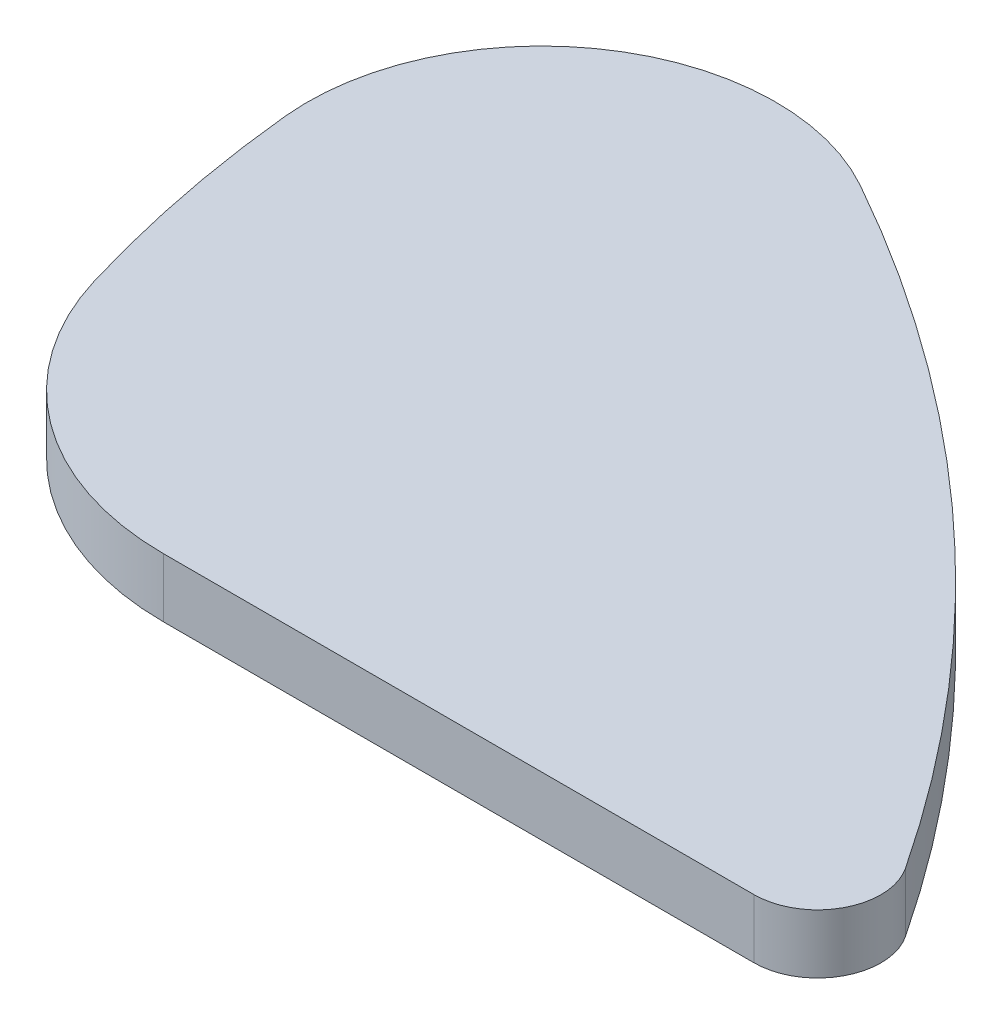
ISO-10303-21;
HEADER;
FILE_DESCRIPTION(('STEP AP214'),'2;1');
FILE_NAME('part.step','',(''),(''),'','','');
FILE_SCHEMA(('AUTOMOTIVE_DESIGN { 1 0 10303 214 1 1 1 1 }'));
ENDSEC;
DATA;
#1=APPLICATION_CONTEXT('core data for automotive mechanical design processes');
#2=APPLICATION_PROTOCOL_DEFINITION('international standard','automotive_design',2000,#1);
#3=PRODUCT_CONTEXT('',#1,'mechanical');
#4=PRODUCT('Part','Part','',(#3));
#5=PRODUCT_RELATED_PRODUCT_CATEGORY('part','',(#4));
#6=PRODUCT_DEFINITION_FORMATION('','',#4);
#7=PRODUCT_DEFINITION_CONTEXT('part definition',#1,'design');
#8=PRODUCT_DEFINITION('design','',#6,#7);
#9=PRODUCT_DEFINITION_SHAPE('','',#8);
#10=(LENGTH_UNIT() NAMED_UNIT(*) SI_UNIT(.MILLI.,.METRE.));
#11=(NAMED_UNIT(*) PLANE_ANGLE_UNIT() SI_UNIT($,.RADIAN.));
#12=(NAMED_UNIT(*) SI_UNIT($,.STERADIAN.) SOLID_ANGLE_UNIT());
#13=UNCERTAINTY_MEASURE_WITH_UNIT(LENGTH_MEASURE(1.E-05),#10,'distance_accuracy_value','');
#14=(GEOMETRIC_REPRESENTATION_CONTEXT(3) GLOBAL_UNCERTAINTY_ASSIGNED_CONTEXT((#13)) GLOBAL_UNIT_ASSIGNED_CONTEXT((#10,
#11,#12)) REPRESENTATION_CONTEXT('',''));
#15=CARTESIAN_POINT('',(0.,0.,0.));
#16=DIRECTION('',(0.,0.,1.));
#17=DIRECTION('',(1.,0.,0.));
#18=AXIS2_PLACEMENT_3D('',#15,#16,#17);
#19=CARTESIAN_POINT('',(0.,10.,-47.8588096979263));
#20=DIRECTION('',(0.,-1.,0.));
#21=DIRECTION('',(0.,0.,-1.));
#22=AXIS2_PLACEMENT_3D('',#19,#20,#21);
#23=CYLINDRICAL_SURFACE('',#22,47.8588096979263);
#24=CARTESIAN_POINT('',(0.,0.,-47.8588096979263));
#25=DIRECTION('',(0.,1.,0.));
#26=DIRECTION('',(0.,0.,1.));
#27=AXIS2_PLACEMENT_3D('',#24,#25,#26);
#28=CIRCLE('',#27,47.8588096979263);
#29=CARTESIAN_POINT('',(-45.8297994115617,0.,-34.0713098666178));
#30=VERTEX_POINT('',#29);
#31=CARTESIAN_POINT('',(0.,0.,0.));
#32=VERTEX_POINT('',#31);
#33=EDGE_CURVE('E93',#30,#32,#28,.T.);
#34=ORIENTED_EDGE('',*,*,#33,.T.);
#35=DIRECTION('',(0.,-1.,0.));
#36=VECTOR('',#35,1.);
#37=CARTESIAN_POINT('',(0.,10.,0.));
#38=LINE('',#37,#36);
#39=CARTESIAN_POINT('',(0.,10.,0.));
#40=VERTEX_POINT('',#39);
#41=EDGE_CURVE('E11',#40,#32,#38,.T.);
#42=ORIENTED_EDGE('',*,*,#41,.F.);
#43=CARTESIAN_POINT('',(0.,10.,-47.8588096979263));
#44=DIRECTION('',(0.,1.,0.));
#45=DIRECTION('',(0.,0.,1.));
#46=AXIS2_PLACEMENT_3D('',#43,#44,#45);
#47=CIRCLE('',#46,47.8588096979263);
#48=CARTESIAN_POINT('',(-45.8297994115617,10.,-34.0713098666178));
#49=VERTEX_POINT('',#48);
#50=EDGE_CURVE('E118',#49,#40,#47,.T.);
#51=ORIENTED_EDGE('',*,*,#50,.F.);
#52=DIRECTION('',(0.,-1.,0.));
#53=VECTOR('',#52,1.);
#54=CARTESIAN_POINT('',(-45.8297994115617,10.,-34.0713098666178));
#55=LINE('',#54,#53);
#56=EDGE_CURVE('E106',#49,#30,#55,.T.);
#57=ORIENTED_EDGE('',*,*,#56,.T.);
#58=EDGE_LOOP('',(#34,#42,#51,#57));
#59=FACE_BOUND('',#58,.T.);
#60=ADVANCED_FACE('F31',(#59),#23,.T.);
#61=CARTESIAN_POINT('',(0.,10.,0.));
#62=DIRECTION('',(0.,0.,-1.));
#63=DIRECTION('',(-1.,0.,0.));
#64=AXIS2_PLACEMENT_3D('',#61,#62,#63);
#65=PLANE('',#64);
#66=DIRECTION('',(1.,0.,0.));
#67=VECTOR('',#66,1.);
#68=CARTESIAN_POINT('',(0.,0.,0.));
#69=LINE('',#68,#67);
#70=CARTESIAN_POINT('',(100.,0.,0.));
#71=VERTEX_POINT('',#70);
#72=EDGE_CURVE('E89',#32,#71,#69,.T.);
#73=ORIENTED_EDGE('',*,*,#72,.T.);
#74=DIRECTION('',(0.,-1.,0.));
#75=VECTOR('',#74,1.);
#76=CARTESIAN_POINT('',(100.,10.,0.));
#77=LINE('',#76,#75);
#78=CARTESIAN_POINT('',(100.,10.,0.));
#79=VERTEX_POINT('',#78);
#80=EDGE_CURVE('E38',#79,#71,#77,.T.);
#81=ORIENTED_EDGE('',*,*,#80,.F.);
#82=DIRECTION('',(1.,0.,0.));
#83=VECTOR('',#82,1.);
#84=CARTESIAN_POINT('',(0.,10.,0.));
#85=LINE('',#84,#83);
#86=EDGE_CURVE('E102',#40,#79,#85,.T.);
#87=ORIENTED_EDGE('',*,*,#86,.F.);
#88=ORIENTED_EDGE('',*,*,#41,.T.);
#89=EDGE_LOOP('',(#73,#81,#87,#88));
#90=FACE_BOUND('',#89,.T.);
#91=ADVANCED_FACE('F101',(#90),#65,.F.);
#92=CARTESIAN_POINT('',(100.,10.,-10.7355617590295));
#93=DIRECTION('',(0.,-1.,0.));
#94=DIRECTION('',(0.,0.,-1.));
#95=AXIS2_PLACEMENT_3D('',#92,#93,#94);
#96=CYLINDRICAL_SURFACE('',#95,10.7355617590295);
#97=CARTESIAN_POINT('',(100.,0.,-10.7355617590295));
#98=DIRECTION('',(0.,1.,0.));
#99=DIRECTION('',(0.,0.,1.));
#100=AXIS2_PLACEMENT_3D('',#97,#98,#99);
#101=CIRCLE('',#100,10.7355617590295);
#102=CARTESIAN_POINT('',(108.955128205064,0.,-16.6565384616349));
#103=VERTEX_POINT('',#102);
#104=EDGE_CURVE('E95',#71,#103,#101,.T.);
#105=ORIENTED_EDGE('',*,*,#104,.T.);
#106=DIRECTION('',(0.,-1.,0.));
#107=VECTOR('',#106,1.);
#108=CARTESIAN_POINT('',(108.955128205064,10.,-16.6565384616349));
#109=LINE('',#108,#107);
#110=CARTESIAN_POINT('',(108.955128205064,10.,-16.6565384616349));
#111=VERTEX_POINT('',#110);
#112=EDGE_CURVE('E139',#111,#103,#109,.T.);
#113=ORIENTED_EDGE('',*,*,#112,.F.);
#114=CARTESIAN_POINT('',(100.,10.,-10.7355617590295));
#115=DIRECTION('',(0.,1.,0.));
#116=DIRECTION('',(0.,0.,1.));
#117=AXIS2_PLACEMENT_3D('',#114,#115,#116);
#118=CIRCLE('',#117,10.7355617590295);
#119=EDGE_CURVE('E121',#79,#111,#118,.T.);
#120=ORIENTED_EDGE('',*,*,#119,.F.);
#121=ORIENTED_EDGE('',*,*,#80,.T.);
#122=EDGE_LOOP('',(#105,#113,#120,#121));
#123=FACE_BOUND('',#122,.T.);
#124=ADVANCED_FACE('F143',(#123),#96,.T.);
#125=CARTESIAN_POINT('',(-139.72006541,10.,147.763221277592));
#126=DIRECTION('',(0.,-1.,0.));
#127=DIRECTION('',(0.,0.,-1.));
#128=AXIS2_PLACEMENT_3D('',#125,#126,#127);
#129=CYLINDRICAL_SURFACE('',#128,298.116100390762);
#130=CARTESIAN_POINT('',(-139.72006541,0.,147.763221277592));
#131=DIRECTION('',(0.,1.,0.));
#132=DIRECTION('',(0.,0.,1.));
#133=AXIS2_PLACEMENT_3D('',#130,#131,#132);
#134=CIRCLE('',#133,298.116100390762);
#135=CARTESIAN_POINT('',(45.5528207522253,0.,-85.7901280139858));
#136=VERTEX_POINT('',#135);
#137=EDGE_CURVE('E110',#103,#136,#134,.T.);
#138=ORIENTED_EDGE('',*,*,#137,.T.);
#139=DIRECTION('',(0.,-1.,0.));
#140=VECTOR('',#139,1.);
#141=CARTESIAN_POINT('',(45.5528207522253,10.,-85.7901280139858));
#142=LINE('',#141,#140);
#143=CARTESIAN_POINT('',(45.5528207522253,10.,-85.7901280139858));
#144=VERTEX_POINT('',#143);
#145=EDGE_CURVE('E136',#144,#136,#142,.T.);
#146=ORIENTED_EDGE('',*,*,#145,.F.);
#147=CARTESIAN_POINT('',(-139.72006541,10.,147.763221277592));
#148=DIRECTION('',(0.,1.,0.));
#149=DIRECTION('',(0.,0.,1.));
#150=AXIS2_PLACEMENT_3D('',#147,#148,#149);
#151=CIRCLE('',#150,298.116100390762);
#152=EDGE_CURVE('E123',#111,#144,#151,.T.);
#153=ORIENTED_EDGE('',*,*,#152,.F.);
#154=ORIENTED_EDGE('',*,*,#112,.T.);
#155=EDGE_LOOP('',(#138,#146,#153,#154));
#156=FACE_BOUND('',#155,.T.);
#157=ADVANCED_FACE('F151',(#156),#129,.T.);
#158=CARTESIAN_POINT('',(-144.337210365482,10.,153.583553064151));
#159=DIRECTION('',(0.,-1.,0.));
#160=DIRECTION('',(0.,0.,-1.));
#161=AXIS2_PLACEMENT_3D('',#158,#159,#160);
#162=CYLINDRICAL_SURFACE('',#161,305.545386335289);
#163=CARTESIAN_POINT('',(-144.337210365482,0.,153.583553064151));
#164=DIRECTION('',(0.,1.,0.));
#165=DIRECTION('',(0.,0.,1.));
#166=AXIS2_PLACEMENT_3D('',#163,#164,#165);
#167=CIRCLE('',#166,305.545386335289);
#168=CARTESIAN_POINT('',(4.94047821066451,0.,-113.013811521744));
#169=VERTEX_POINT('',#168);
#170=EDGE_CURVE('E112',#136,#169,#167,.T.);
#171=ORIENTED_EDGE('',*,*,#170,.T.);
#172=DIRECTION('',(0.,-1.,0.));
#173=VECTOR('',#172,1.);
#174=CARTESIAN_POINT('',(4.94047821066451,10.,-113.013811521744));
#175=LINE('',#174,#173);
#176=CARTESIAN_POINT('',(4.94047821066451,10.,-113.013811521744));
#177=VERTEX_POINT('',#176);
#178=EDGE_CURVE('E133',#177,#169,#175,.T.);
#179=ORIENTED_EDGE('',*,*,#178,.F.);
#180=CARTESIAN_POINT('',(-144.337210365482,10.,153.583553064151));
#181=DIRECTION('',(0.,1.,0.));
#182=DIRECTION('',(0.,0.,1.));
#183=AXIS2_PLACEMENT_3D('',#180,#181,#182);
#184=CIRCLE('',#183,305.545386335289);
#185=EDGE_CURVE('E125',#144,#177,#184,.T.);
#186=ORIENTED_EDGE('',*,*,#185,.F.);
#187=ORIENTED_EDGE('',*,*,#145,.T.);
#188=EDGE_LOOP('',(#171,#179,#186,#187));
#189=FACE_BOUND('',#188,.T.);
#190=ADVANCED_FACE('F154',(#189),#162,.T.);
#191=CARTESIAN_POINT('',(-14.42334584,10.,-78.43165454));
#192=DIRECTION('',(0.,-1.,0.));
#193=DIRECTION('',(0.,0.,-1.));
#194=AXIS2_PLACEMENT_3D('',#191,#192,#193);
#195=CYLINDRICAL_SURFACE('',#194,39.6343697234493);
#196=CARTESIAN_POINT('',(-14.42334584,0.,-78.43165454));
#197=DIRECTION('',(0.,1.,0.));
#198=DIRECTION('',(0.,0.,1.));
#199=AXIS2_PLACEMENT_3D('',#196,#197,#198);
#200=CIRCLE('',#199,39.6343697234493);
#201=CARTESIAN_POINT('',(-53.8590071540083,0.,-74.4678331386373));
#202=VERTEX_POINT('',#201);
#203=EDGE_CURVE('E114',#169,#202,#200,.T.);
#204=ORIENTED_EDGE('',*,*,#203,.T.);
#205=DIRECTION('',(0.,-1.,0.));
#206=VECTOR('',#205,1.);
#207=CARTESIAN_POINT('',(-53.8590071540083,10.,-74.4678331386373));
#208=LINE('',#207,#206);
#209=CARTESIAN_POINT('',(-53.8590071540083,10.,-74.4678331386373));
#210=VERTEX_POINT('',#209);
#211=EDGE_CURVE('E130',#210,#202,#208,.T.);
#212=ORIENTED_EDGE('',*,*,#211,.F.);
#213=CARTESIAN_POINT('',(-14.42334584,10.,-78.43165454));
#214=DIRECTION('',(0.,1.,0.));
#215=DIRECTION('',(0.,0.,1.));
#216=AXIS2_PLACEMENT_3D('',#213,#214,#215);
#217=CIRCLE('',#216,39.6343697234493);
#218=EDGE_CURVE('E50',#177,#210,#217,.T.);
#219=ORIENTED_EDGE('',*,*,#218,.F.);
#220=ORIENTED_EDGE('',*,*,#178,.T.);
#221=EDGE_LOOP('',(#204,#212,#219,#220));
#222=FACE_BOUND('',#221,.T.);
#223=ADVANCED_FACE('F157',(#222),#195,.T.);
#224=CARTESIAN_POINT('',(159.850985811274,10.,-95.948599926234));
#225=DIRECTION('',(0.,-1.,0.));
#226=DIRECTION('',(0.,0.,-1.));
#227=AXIS2_PLACEMENT_3D('',#224,#225,#226);
#228=CYLINDRICAL_SURFACE('',#227,214.786834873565);
#229=CARTESIAN_POINT('',(159.850985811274,0.,-95.948599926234));
#230=DIRECTION('',(0.,1.,0.));
#231=DIRECTION('',(0.,0.,1.));
#232=AXIS2_PLACEMENT_3D('',#229,#230,#231);
#233=CIRCLE('',#232,214.786834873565);
#234=EDGE_CURVE('E116',#202,#30,#233,.T.);
#235=ORIENTED_EDGE('',*,*,#234,.T.);
#236=ORIENTED_EDGE('',*,*,#56,.F.);
#237=CARTESIAN_POINT('',(159.850985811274,10.,-95.948599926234));
#238=DIRECTION('',(0.,1.,0.));
#239=DIRECTION('',(0.,0.,1.));
#240=AXIS2_PLACEMENT_3D('',#237,#238,#239);
#241=CIRCLE('',#240,214.786834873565);
#242=EDGE_CURVE('E45',#210,#49,#241,.T.);
#243=ORIENTED_EDGE('',*,*,#242,.F.);
#244=ORIENTED_EDGE('',*,*,#211,.T.);
#245=EDGE_LOOP('',(#235,#236,#243,#244));
#246=FACE_BOUND('',#245,.T.);
#247=ADVANCED_FACE('F159',(#246),#228,.T.);
#248=CARTESIAN_POINT('',(0.,10.,-47.8588096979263));
#249=DIRECTION('',(0.,1.,0.));
#250=DIRECTION('',(0.,0.,1.));
#251=AXIS2_PLACEMENT_3D('',#248,#249,#250);
#252=PLANE('',#251);
#253=ORIENTED_EDGE('',*,*,#50,.T.);
#254=ORIENTED_EDGE('',*,*,#86,.T.);
#255=ORIENTED_EDGE('',*,*,#119,.T.);
#256=ORIENTED_EDGE('',*,*,#152,.T.);
#257=ORIENTED_EDGE('',*,*,#185,.T.);
#258=ORIENTED_EDGE('',*,*,#218,.T.);
#259=ORIENTED_EDGE('',*,*,#242,.T.);
#260=EDGE_LOOP('',(#253,#254,#255,#256,#257,#258,#259));
#261=FACE_BOUND('',#260,.T.);
#262=ADVANCED_FACE('F146',(#261),#252,.T.);
#263=CARTESIAN_POINT('',(0.,0.,-47.8588096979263));
#264=DIRECTION('',(0.,1.,0.));
#265=DIRECTION('',(0.,0.,1.));
#266=AXIS2_PLACEMENT_3D('',#263,#264,#265);
#267=PLANE('',#266);
#268=ORIENTED_EDGE('',*,*,#33,.F.);
#269=ORIENTED_EDGE('',*,*,#234,.F.);
#270=ORIENTED_EDGE('',*,*,#203,.F.);
#271=ORIENTED_EDGE('',*,*,#170,.F.);
#272=ORIENTED_EDGE('',*,*,#137,.F.);
#273=ORIENTED_EDGE('',*,*,#104,.F.);
#274=ORIENTED_EDGE('',*,*,#72,.F.);
#275=EDGE_LOOP('',(#268,#269,#270,#271,#272,#273,#274));
#276=FACE_BOUND('',#275,.T.);
#277=ADVANCED_FACE('F90',(#276),#267,.F.);
#278=CLOSED_SHELL('',(#60,#91,#124,#157,#190,#223,#247,#262,#277));
#279=MANIFOLD_SOLID_BREP('B2',#278);
#280=ADVANCED_BREP_SHAPE_REPRESENTATION('',(#18,#279),#14);
#281=SHAPE_DEFINITION_REPRESENTATION(#9,#280);
ENDSEC;
END-ISO-10303-21;
